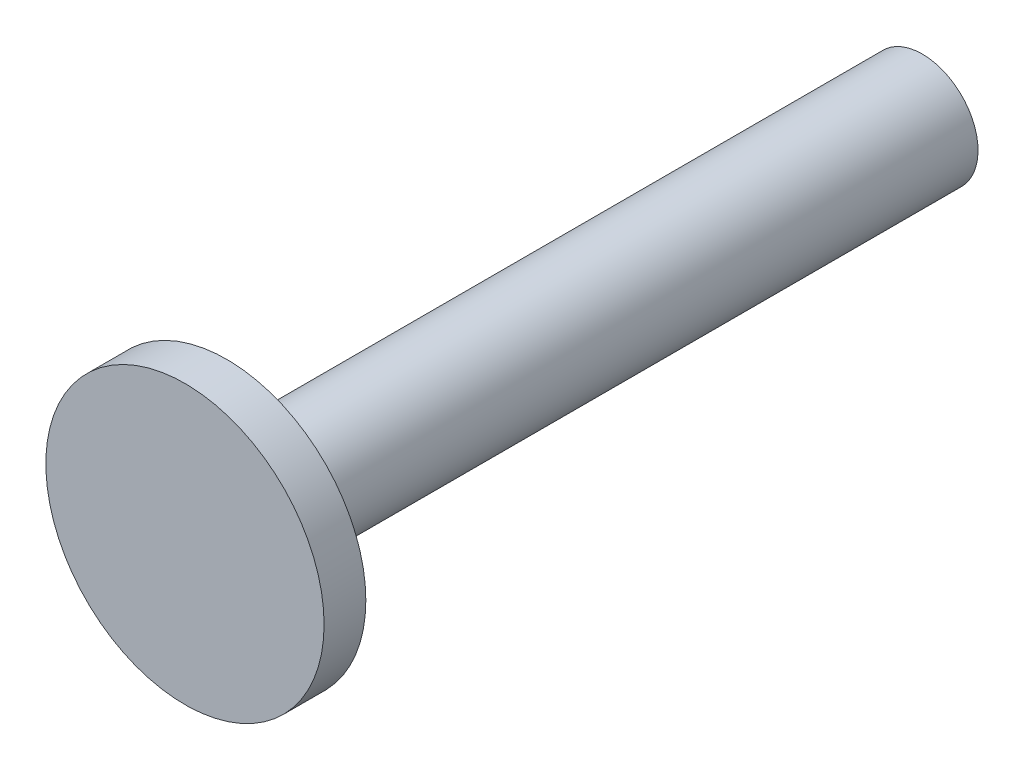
ISO-10303-21;
HEADER;
FILE_DESCRIPTION(('STEP AP214'),'2;1');
FILE_NAME('part.step','',(''),(''),'','','');
FILE_SCHEMA(('AUTOMOTIVE_DESIGN { 1 0 10303 214 1 1 1 1 }'));
ENDSEC;
DATA;
#1=APPLICATION_CONTEXT('core data for automotive mechanical design processes');
#2=APPLICATION_PROTOCOL_DEFINITION('international standard','automotive_design',2000,#1);
#3=PRODUCT_CONTEXT('',#1,'mechanical');
#4=PRODUCT('Part','Part','',(#3));
#5=PRODUCT_RELATED_PRODUCT_CATEGORY('part','',(#4));
#6=PRODUCT_DEFINITION_FORMATION('','',#4);
#7=PRODUCT_DEFINITION_CONTEXT('part definition',#1,'design');
#8=PRODUCT_DEFINITION('design','',#6,#7);
#9=PRODUCT_DEFINITION_SHAPE('','',#8);
#10=(LENGTH_UNIT() NAMED_UNIT(*) SI_UNIT(.MILLI.,.METRE.));
#11=(NAMED_UNIT(*) PLANE_ANGLE_UNIT() SI_UNIT($,.RADIAN.));
#12=(NAMED_UNIT(*) SI_UNIT($,.STERADIAN.) SOLID_ANGLE_UNIT());
#13=UNCERTAINTY_MEASURE_WITH_UNIT(LENGTH_MEASURE(1.E-05),#10,'distance_accuracy_value','');
#14=(GEOMETRIC_REPRESENTATION_CONTEXT(3) GLOBAL_UNCERTAINTY_ASSIGNED_CONTEXT((#13)) GLOBAL_UNIT_ASSIGNED_CONTEXT((#10,
#11,#12)) REPRESENTATION_CONTEXT('',''));
#15=CARTESIAN_POINT('',(0.,0.,0.));
#16=DIRECTION('',(0.,0.,1.));
#17=DIRECTION('',(1.,0.,0.));
#18=AXIS2_PLACEMENT_3D('',#15,#16,#17);
#19=CARTESIAN_POINT('',(20.0000000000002,-24.7474487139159,3.));
#20=DIRECTION('',(0.,0.,-1.));
#21=DIRECTION('',(-1.,0.,0.));
#22=AXIS2_PLACEMENT_3D('',#19,#20,#21);
#23=CYLINDRICAL_SURFACE('',#22,10.);
#24=CARTESIAN_POINT('',(20.0000000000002,-24.7474487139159,3.));
#25=DIRECTION('',(0.,0.,1.));
#26=DIRECTION('',(1.,0.,0.));
#27=AXIS2_PLACEMENT_3D('',#24,#25,#26);
#28=CIRCLE('',#27,10.);
#29=CARTESIAN_POINT('',(30.0000000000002,-24.7474487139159,3.));
#30=VERTEX_POINT('',#29);
#31=EDGE_CURVE('E38',#30,#30,#28,.T.);
#32=ORIENTED_EDGE('',*,*,#31,.F.);
#33=EDGE_LOOP('',(#32));
#34=FACE_BOUND('',#33,.T.);
#35=CARTESIAN_POINT('',(20.0000000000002,-24.7474487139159,0.));
#36=DIRECTION('',(0.,0.,1.));
#37=DIRECTION('',(1.,0.,0.));
#38=AXIS2_PLACEMENT_3D('',#35,#36,#37);
#39=CIRCLE('',#38,10.);
#40=CARTESIAN_POINT('',(30.0000000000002,-24.7474487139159,0.));
#41=VERTEX_POINT('',#40);
#42=EDGE_CURVE('E34',#41,#41,#39,.T.);
#43=ORIENTED_EDGE('',*,*,#42,.T.);
#44=EDGE_LOOP('',(#43));
#45=FACE_BOUND('',#44,.T.);
#46=ADVANCED_FACE('F31',(#34,#45),#23,.T.);
#47=CARTESIAN_POINT('',(20.0000000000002,-24.7474487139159,3.));
#48=DIRECTION('',(0.,0.,1.));
#49=DIRECTION('',(1.,0.,0.));
#50=AXIS2_PLACEMENT_3D('',#47,#48,#49);
#51=PLANE('',#50);
#52=ORIENTED_EDGE('',*,*,#31,.T.);
#53=EDGE_LOOP('',(#52));
#54=FACE_BOUND('',#53,.T.);
#55=ADVANCED_FACE('F55',(#54),#51,.T.);
#56=CARTESIAN_POINT('',(20.0000000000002,-24.7474487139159,0.));
#57=DIRECTION('',(0.,0.,1.));
#58=DIRECTION('',(1.,0.,0.));
#59=AXIS2_PLACEMENT_3D('',#56,#57,#58);
#60=PLANE('',#59);
#61=CARTESIAN_POINT('',(20.0000000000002,-24.7474487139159,0.));
#62=DIRECTION('',(0.,0.,-1.));
#63=DIRECTION('',(-1.,0.,0.));
#64=AXIS2_PLACEMENT_3D('',#61,#62,#63);
#65=CIRCLE('',#64,4.);
#66=CARTESIAN_POINT('',(16.0000000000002,-24.7474487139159,0.));
#67=VERTEX_POINT('',#66);
#68=EDGE_CURVE('E10',#67,#67,#65,.T.);
#69=ORIENTED_EDGE('',*,*,#68,.F.);
#70=EDGE_LOOP('',(#69));
#71=FACE_BOUND('',#70,.T.);
#72=ORIENTED_EDGE('',*,*,#42,.F.);
#73=EDGE_LOOP('',(#72));
#74=FACE_BOUND('',#73,.T.);
#75=ADVANCED_FACE('F52',(#71,#74),#60,.F.);
#76=CARTESIAN_POINT('',(20.0000000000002,-24.7474487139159,-64.3137084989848));
#77=DIRECTION('',(0.,0.,1.));
#78=DIRECTION('',(1.,0.,0.));
#79=AXIS2_PLACEMENT_3D('',#76,#77,#78);
#80=CYLINDRICAL_SURFACE('',#79,4.);
#81=ORIENTED_EDGE('',*,*,#68,.T.);
#82=EDGE_LOOP('',(#81));
#83=FACE_BOUND('',#82,.T.);
#84=CARTESIAN_POINT('',(20.0000000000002,-24.7474487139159,-50.));
#85=DIRECTION('',(0.,0.,-1.));
#86=DIRECTION('',(0.,1.,0.));
#87=AXIS2_PLACEMENT_3D('',#84,#85,#86);
#88=CIRCLE('',#87,4.);
#89=CARTESIAN_POINT('',(20.0000000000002,-20.7474487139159,-50.));
#90=VERTEX_POINT('',#89);
#91=EDGE_CURVE('E44',#90,#90,#88,.T.);
#92=ORIENTED_EDGE('',*,*,#91,.F.);
#93=EDGE_LOOP('',(#92));
#94=FACE_BOUND('',#93,.T.);
#95=ADVANCED_FACE('F54',(#83,#94),#80,.T.);
#96=CARTESIAN_POINT('',(0.,0.,-50.));
#97=DIRECTION('',(0.,0.,-1.));
#98=DIRECTION('',(-1.,0.,0.));
#99=AXIS2_PLACEMENT_3D('',#96,#97,#98);
#100=PLANE('',#99);
#101=ORIENTED_EDGE('',*,*,#91,.T.);
#102=EDGE_LOOP('',(#101));
#103=FACE_BOUND('',#102,.T.);
#104=ADVANCED_FACE('F61',(#103),#100,.T.);
#105=CLOSED_SHELL('',(#46,#55,#75,#95,#104));
#106=MANIFOLD_SOLID_BREP('B2',#105);
#107=ADVANCED_BREP_SHAPE_REPRESENTATION('',(#18,#106),#14);
#108=SHAPE_DEFINITION_REPRESENTATION(#9,#107);
ENDSEC;
END-ISO-10303-21;
